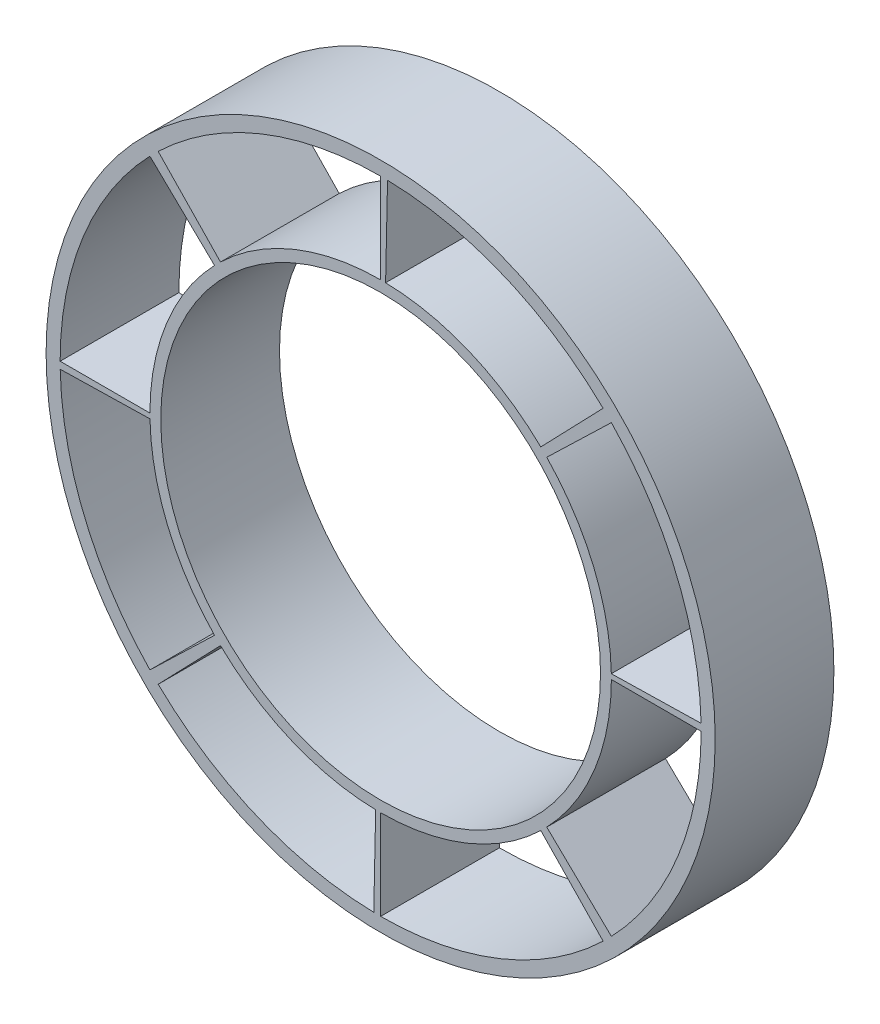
ISO-10303-21;
HEADER;
FILE_DESCRIPTION(('STEP AP214'),'2;1');
FILE_NAME('part.step','',(''),(''),'','','');
FILE_SCHEMA(('AUTOMOTIVE_DESIGN { 1 0 10303 214 1 1 1 1 }'));
ENDSEC;
DATA;
#1=APPLICATION_CONTEXT('core data for automotive mechanical design processes');
#2=APPLICATION_PROTOCOL_DEFINITION('international standard','automotive_design',2000,#1);
#3=PRODUCT_CONTEXT('',#1,'mechanical');
#4=PRODUCT('Part','Part','',(#3));
#5=PRODUCT_RELATED_PRODUCT_CATEGORY('part','',(#4));
#6=PRODUCT_DEFINITION_FORMATION('','',#4);
#7=PRODUCT_DEFINITION_CONTEXT('part definition',#1,'design');
#8=PRODUCT_DEFINITION('design','',#6,#7);
#9=PRODUCT_DEFINITION_SHAPE('','',#8);
#10=(LENGTH_UNIT() NAMED_UNIT(*) SI_UNIT(.MILLI.,.METRE.));
#11=(NAMED_UNIT(*) PLANE_ANGLE_UNIT() SI_UNIT($,.RADIAN.));
#12=(NAMED_UNIT(*) SI_UNIT($,.STERADIAN.) SOLID_ANGLE_UNIT());
#13=UNCERTAINTY_MEASURE_WITH_UNIT(LENGTH_MEASURE(1.E-05),#10,'distance_accuracy_value','');
#14=(GEOMETRIC_REPRESENTATION_CONTEXT(3) GLOBAL_UNCERTAINTY_ASSIGNED_CONTEXT((#13)) GLOBAL_UNIT_ASSIGNED_CONTEXT((#10,
#11,#12)) REPRESENTATION_CONTEXT('',''));
#15=CARTESIAN_POINT('',(0.,0.,0.));
#16=DIRECTION('',(0.,0.,1.));
#17=DIRECTION('',(1.,0.,0.));
#18=AXIS2_PLACEMENT_3D('',#15,#16,#17);
#19=CARTESIAN_POINT('',(0.,0.,10.));
#20=DIRECTION('',(0.,0.,-1.));
#21=DIRECTION('',(-1.,0.,0.));
#22=AXIS2_PLACEMENT_3D('',#19,#20,#21);
#23=CYLINDRICAL_SURFACE('',#22,26.9983120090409);
#24=CARTESIAN_POINT('',(0.,0.,0.));
#25=DIRECTION('',(0.,0.,1.));
#26=DIRECTION('',(1.,0.,0.));
#27=AXIS2_PLACEMENT_3D('',#24,#25,#26);
#28=CIRCLE('',#27,26.9983120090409);
#29=CARTESIAN_POINT('',(-26.9920373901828,-0.582038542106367,0.));
#30=VERTEX_POINT('',#29);
#31=CARTESIAN_POINT('',(-19.4359711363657,-18.7390468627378,0.));
#32=VERTEX_POINT('',#31);
#33=EDGE_CURVE('E430',#30,#32,#28,.T.);
#34=ORIENTED_EDGE('',*,*,#33,.F.);
#35=DIRECTION('',(0.,0.,-1.));
#36=VECTOR('',#35,1.);
#37=CARTESIAN_POINT('',(-26.9920373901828,-0.582038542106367,10.));
#38=LINE('',#37,#36);
#39=CARTESIAN_POINT('',(-26.9920373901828,-0.582038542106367,10.));
#40=VERTEX_POINT('',#39);
#41=EDGE_CURVE('E11',#40,#30,#38,.T.);
#42=ORIENTED_EDGE('',*,*,#41,.F.);
#43=CARTESIAN_POINT('',(0.,0.,10.));
#44=DIRECTION('',(0.,0.,1.));
#45=DIRECTION('',(1.,0.,0.));
#46=AXIS2_PLACEMENT_3D('',#43,#44,#45);
#47=CIRCLE('',#46,26.9983120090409);
#48=CARTESIAN_POINT('',(-19.4359711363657,-18.7390468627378,10.));
#49=VERTEX_POINT('',#48);
#50=EDGE_CURVE('E266',#40,#49,#47,.T.);
#51=ORIENTED_EDGE('',*,*,#50,.T.);
#52=DIRECTION('',(0.,0.,-1.));
#53=VECTOR('',#52,1.);
#54=CARTESIAN_POINT('',(-19.4359711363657,-18.7390468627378,10.));
#55=LINE('',#54,#53);
#56=EDGE_CURVE('E54',#49,#32,#55,.T.);
#57=ORIENTED_EDGE('',*,*,#56,.T.);
#58=EDGE_LOOP('',(#34,#42,#51,#57));
#59=FACE_BOUND('',#58,.T.);
#60=ADVANCED_FACE('F35',(#59),#23,.F.);
#61=CARTESIAN_POINT('',(0.,0.,10.));
#62=DIRECTION('',(-0.0215583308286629,0.999767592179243,0.));
#63=DIRECTION('',(-0.999767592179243,-0.0215583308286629,0.));
#64=AXIS2_PLACEMENT_3D('',#61,#62,#63);
#65=PLANE('',#64);
#66=DIRECTION('',(0.999767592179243,0.0215583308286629,0.));
#67=VECTOR('',#66,1.);
#68=CARTESIAN_POINT('',(0.,0.,0.));
#69=LINE('',#68,#67);
#70=CARTESIAN_POINT('',(-19.4314540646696,-0.419007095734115,0.));
#71=VERTEX_POINT('',#70);
#72=EDGE_CURVE('E271',#30,#71,#69,.T.);
#73=ORIENTED_EDGE('',*,*,#72,.T.);
#74=DIRECTION('',(0.,0.,-1.));
#75=VECTOR('',#74,1.);
#76=CARTESIAN_POINT('',(-19.4314540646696,-0.419007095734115,10.));
#77=LINE('',#76,#75);
#78=CARTESIAN_POINT('',(-19.4314540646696,-0.419007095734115,10.));
#79=VERTEX_POINT('',#78);
#80=EDGE_CURVE('E45',#79,#71,#77,.T.);
#81=ORIENTED_EDGE('',*,*,#80,.F.);
#82=DIRECTION('',(0.999767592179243,0.0215583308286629,0.));
#83=VECTOR('',#82,1.);
#84=CARTESIAN_POINT('',(0.,0.,10.));
#85=LINE('',#84,#83);
#86=EDGE_CURVE('E260',#40,#79,#85,.T.);
#87=ORIENTED_EDGE('',*,*,#86,.F.);
#88=ORIENTED_EDGE('',*,*,#41,.T.);
#89=EDGE_LOOP('',(#73,#81,#87,#88));
#90=FACE_BOUND('',#89,.T.);
#91=ADVANCED_FACE('F269',(#90),#65,.F.);
#92=CARTESIAN_POINT('',(0.,0.,10.));
#93=DIRECTION('',(0.,0.,-1.));
#94=DIRECTION('',(-1.,0.,0.));
#95=AXIS2_PLACEMENT_3D('',#92,#93,#94);
#96=CYLINDRICAL_SURFACE('',#95,19.4359711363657);
#97=CARTESIAN_POINT('',(0.,0.,0.));
#98=DIRECTION('',(0.,0.,1.));
#99=DIRECTION('',(1.,0.,0.));
#100=AXIS2_PLACEMENT_3D('',#97,#98,#99);
#101=CIRCLE('',#100,19.4359711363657);
#102=CARTESIAN_POINT('',(-13.9918737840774,-13.4901609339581,0.));
#103=VERTEX_POINT('',#102);
#104=EDGE_CURVE('E433',#71,#103,#101,.T.);
#105=ORIENTED_EDGE('',*,*,#104,.T.);
#106=DIRECTION('',(0.,0.,-1.));
#107=VECTOR('',#106,1.);
#108=CARTESIAN_POINT('',(-13.9918737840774,-13.4901609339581,10.));
#109=LINE('',#108,#107);
#110=CARTESIAN_POINT('',(-13.9918737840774,-13.4901609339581,10.));
#111=VERTEX_POINT('',#110);
#112=EDGE_CURVE('E152',#111,#103,#109,.T.);
#113=ORIENTED_EDGE('',*,*,#112,.F.);
#114=CARTESIAN_POINT('',(0.,0.,10.));
#115=DIRECTION('',(0.,0.,1.));
#116=DIRECTION('',(1.,0.,0.));
#117=AXIS2_PLACEMENT_3D('',#114,#115,#116);
#118=CIRCLE('',#117,19.4359711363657);
#119=EDGE_CURVE('E252',#79,#111,#118,.T.);
#120=ORIENTED_EDGE('',*,*,#119,.F.);
#121=ORIENTED_EDGE('',*,*,#80,.T.);
#122=EDGE_LOOP('',(#105,#113,#120,#121));
#123=FACE_BOUND('',#122,.T.);
#124=ADVANCED_FACE('F254',(#123),#96,.T.);
#125=CARTESIAN_POINT('',(0.,0.,10.));
#126=DIRECTION('',(0.,0.,-1.));
#127=DIRECTION('',(-1.,0.,0.));
#128=AXIS2_PLACEMENT_3D('',#125,#126,#127);
#129=CYLINDRICAL_SURFACE('',#128,26.9983120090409);
#130=CARTESIAN_POINT('',(0.,0.,0.));
#131=DIRECTION('',(0.,0.,1.));
#132=DIRECTION('',(1.,0.,0.));
#133=AXIS2_PLACEMENT_3D('',#130,#131,#132);
#134=CIRCLE('',#133,26.9983120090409);
#135=CARTESIAN_POINT('',(-18.7390468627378,-19.4359711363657,0.));
#136=VERTEX_POINT('',#135);
#137=CARTESIAN_POINT('',(-0.580474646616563,-26.9920710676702,0.));
#138=VERTEX_POINT('',#137);
#139=EDGE_CURVE('E418',#136,#138,#134,.T.);
#140=ORIENTED_EDGE('',*,*,#139,.F.);
#141=DIRECTION('',(0.,0.,-1.));
#142=VECTOR('',#141,1.);
#143=CARTESIAN_POINT('',(-18.7390468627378,-19.4359711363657,10.));
#144=LINE('',#143,#142);
#145=CARTESIAN_POINT('',(-18.7390468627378,-19.4359711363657,10.));
#146=VERTEX_POINT('',#145);
#147=EDGE_CURVE('E284',#146,#136,#144,.T.);
#148=ORIENTED_EDGE('',*,*,#147,.F.);
#149=CARTESIAN_POINT('',(0.,0.,10.));
#150=DIRECTION('',(0.,0.,1.));
#151=DIRECTION('',(1.,0.,0.));
#152=AXIS2_PLACEMENT_3D('',#149,#150,#151);
#153=CIRCLE('',#152,26.9983120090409);
#154=CARTESIAN_POINT('',(-0.580474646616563,-26.9920710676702,10.));
#155=VERTEX_POINT('',#154);
#156=EDGE_CURVE('E510',#146,#155,#153,.T.);
#157=ORIENTED_EDGE('',*,*,#156,.T.);
#158=DIRECTION('',(0.,0.,-1.));
#159=VECTOR('',#158,1.);
#160=CARTESIAN_POINT('',(-0.580474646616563,-26.9920710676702,10.));
#161=LINE('',#160,#159);
#162=EDGE_CURVE('E276',#155,#138,#161,.T.);
#163=ORIENTED_EDGE('',*,*,#162,.T.);
#164=EDGE_LOOP('',(#140,#148,#157,#163));
#165=FACE_BOUND('',#164,.T.);
#166=ADVANCED_FACE('F567',(#165),#129,.F.);
#167=CARTESIAN_POINT('',(0.,0.,10.));
#168=DIRECTION('',(0.719895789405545,-0.694082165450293,0.));
#169=DIRECTION('',(0.694082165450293,0.719895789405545,0.));
#170=AXIS2_PLACEMENT_3D('',#167,#168,#169);
#171=PLANE('',#170);
#172=DIRECTION('',(-0.694082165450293,-0.719895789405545,0.));
#173=VECTOR('',#172,1.);
#174=CARTESIAN_POINT('',(0.,0.,0.));
#175=LINE('',#174,#173);
#176=CARTESIAN_POINT('',(-13.4901609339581,-13.9918737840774,0.));
#177=VERTEX_POINT('',#176);
#178=EDGE_CURVE('E421',#177,#136,#175,.T.);
#179=ORIENTED_EDGE('',*,*,#178,.F.);
#180=DIRECTION('',(0.,0.,-1.));
#181=VECTOR('',#180,1.);
#182=CARTESIAN_POINT('',(-13.4901609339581,-13.9918737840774,10.));
#183=LINE('',#182,#181);
#184=CARTESIAN_POINT('',(-13.4901609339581,-13.9918737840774,10.));
#185=VERTEX_POINT('',#184);
#186=EDGE_CURVE('E282',#185,#177,#183,.T.);
#187=ORIENTED_EDGE('',*,*,#186,.F.);
#188=DIRECTION('',(-0.694082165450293,-0.719895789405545,0.));
#189=VECTOR('',#188,1.);
#190=CARTESIAN_POINT('',(0.,0.,10.));
#191=LINE('',#190,#189);
#192=EDGE_CURVE('E513',#185,#146,#191,.T.);
#193=ORIENTED_EDGE('',*,*,#192,.T.);
#194=ORIENTED_EDGE('',*,*,#147,.T.);
#195=EDGE_LOOP('',(#179,#187,#193,#194));
#196=FACE_BOUND('',#195,.T.);
#197=ADVANCED_FACE('F563',(#196),#171,.T.);
#198=CARTESIAN_POINT('',(0.,0.,10.));
#199=DIRECTION('',(0.,0.,-1.));
#200=DIRECTION('',(-1.,0.,0.));
#201=AXIS2_PLACEMENT_3D('',#198,#199,#200);
#202=CYLINDRICAL_SURFACE('',#201,19.4359711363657);
#203=CARTESIAN_POINT('',(0.,0.,0.));
#204=DIRECTION('',(0.,0.,1.));
#205=DIRECTION('',(1.,0.,0.));
#206=AXIS2_PLACEMENT_3D('',#203,#204,#205);
#207=CIRCLE('',#206,19.4359711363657);
#208=CARTESIAN_POINT('',(-0.417881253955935,-19.431478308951,0.));
#209=VERTEX_POINT('',#208);
#210=EDGE_CURVE('E424',#177,#209,#207,.T.);
#211=ORIENTED_EDGE('',*,*,#210,.T.);
#212=DIRECTION('',(0.,0.,-1.));
#213=VECTOR('',#212,1.);
#214=CARTESIAN_POINT('',(-0.417881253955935,-19.431478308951,10.));
#215=LINE('',#214,#213);
#216=CARTESIAN_POINT('',(-0.417881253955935,-19.431478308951,10.));
#217=VERTEX_POINT('',#216);
#218=EDGE_CURVE('E278',#217,#209,#215,.T.);
#219=ORIENTED_EDGE('',*,*,#218,.F.);
#220=CARTESIAN_POINT('',(0.,0.,10.));
#221=DIRECTION('',(0.,0.,1.));
#222=DIRECTION('',(1.,0.,0.));
#223=AXIS2_PLACEMENT_3D('',#220,#221,#222);
#224=CIRCLE('',#223,19.4359711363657);
#225=EDGE_CURVE('E516',#185,#217,#224,.T.);
#226=ORIENTED_EDGE('',*,*,#225,.F.);
#227=ORIENTED_EDGE('',*,*,#186,.T.);
#228=EDGE_LOOP('',(#211,#219,#226,#227));
#229=FACE_BOUND('',#228,.T.);
#230=ADVANCED_FACE('F559',(#229),#202,.T.);
#231=CARTESIAN_POINT('',(0.,0.,10.));
#232=DIRECTION('',(0.,0.,-1.));
#233=DIRECTION('',(-1.,0.,0.));
#234=AXIS2_PLACEMENT_3D('',#231,#232,#233);
#235=CYLINDRICAL_SURFACE('',#234,26.9983120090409);
#236=CARTESIAN_POINT('',(0.,0.,0.));
#237=DIRECTION('',(0.,0.,1.));
#238=DIRECTION('',(1.,0.,0.));
#239=AXIS2_PLACEMENT_3D('',#236,#237,#238);
#240=CIRCLE('',#239,26.9983120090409);
#241=CARTESIAN_POINT('',(0.,-26.9983120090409,0.));
#242=VERTEX_POINT('',#241);
#243=CARTESIAN_POINT('',(18.7390468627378,-19.4359711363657,0.));
#244=VERTEX_POINT('',#243);
#245=EDGE_CURVE('E406',#242,#244,#240,.T.);
#246=ORIENTED_EDGE('',*,*,#245,.F.);
#247=DIRECTION('',(0.,0.,-1.));
#248=VECTOR('',#247,1.);
#249=CARTESIAN_POINT('',(0.,-26.9983120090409,10.));
#250=LINE('',#249,#248);
#251=CARTESIAN_POINT('',(0.,-26.9983120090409,10.));
#252=VERTEX_POINT('',#251);
#253=EDGE_CURVE('E279',#252,#242,#250,.T.);
#254=ORIENTED_EDGE('',*,*,#253,.F.);
#255=CARTESIAN_POINT('',(0.,0.,10.));
#256=DIRECTION('',(0.,0.,1.));
#257=DIRECTION('',(1.,0.,0.));
#258=AXIS2_PLACEMENT_3D('',#255,#256,#257);
#259=CIRCLE('',#258,26.9983120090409);
#260=CARTESIAN_POINT('',(18.7390468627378,-19.4359711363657,10.));
#261=VERTEX_POINT('',#260);
#262=EDGE_CURVE('E499',#252,#261,#259,.T.);
#263=ORIENTED_EDGE('',*,*,#262,.T.);
#264=DIRECTION('',(0.,0.,-1.));
#265=VECTOR('',#264,1.);
#266=CARTESIAN_POINT('',(18.7390468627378,-19.4359711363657,10.));
#267=LINE('',#266,#265);
#268=EDGE_CURVE('E286',#261,#244,#267,.T.);
#269=ORIENTED_EDGE('',*,*,#268,.T.);
#270=EDGE_LOOP('',(#246,#254,#263,#269));
#271=FACE_BOUND('',#270,.T.);
#272=ADVANCED_FACE('F562',(#271),#235,.F.);
#273=CARTESIAN_POINT('',(0.,0.,10.));
#274=DIRECTION('',(1.,0.,0.));
#275=DIRECTION('',(0.,0.,-1.));
#276=AXIS2_PLACEMENT_3D('',#273,#274,#275);
#277=PLANE('',#276);
#278=DIRECTION('',(0.,-1.,0.));
#279=VECTOR('',#278,1.);
#280=CARTESIAN_POINT('',(0.,0.,0.));
#281=LINE('',#280,#279);
#282=CARTESIAN_POINT('',(0.,-19.4359711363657,0.));
#283=VERTEX_POINT('',#282);
#284=EDGE_CURVE('E409',#283,#242,#281,.T.);
#285=ORIENTED_EDGE('',*,*,#284,.F.);
#286=DIRECTION('',(0.,0.,-1.));
#287=VECTOR('',#286,1.);
#288=CARTESIAN_POINT('',(0.,-19.4359711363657,10.));
#289=LINE('',#288,#287);
#290=CARTESIAN_POINT('',(0.,-19.4359711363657,10.));
#291=VERTEX_POINT('',#290);
#292=EDGE_CURVE('E292',#291,#283,#289,.T.);
#293=ORIENTED_EDGE('',*,*,#292,.F.);
#294=DIRECTION('',(0.,-1.,0.));
#295=VECTOR('',#294,1.);
#296=CARTESIAN_POINT('',(0.,0.,10.));
#297=LINE('',#296,#295);
#298=EDGE_CURVE('E502',#291,#252,#297,.T.);
#299=ORIENTED_EDGE('',*,*,#298,.T.);
#300=ORIENTED_EDGE('',*,*,#253,.T.);
#301=EDGE_LOOP('',(#285,#293,#299,#300));
#302=FACE_BOUND('',#301,.T.);
#303=ADVANCED_FACE('F580',(#302),#277,.T.);
#304=CARTESIAN_POINT('',(0.,0.,10.));
#305=DIRECTION('',(0.,0.,-1.));
#306=DIRECTION('',(-1.,0.,0.));
#307=AXIS2_PLACEMENT_3D('',#304,#305,#306);
#308=CYLINDRICAL_SURFACE('',#307,19.4359711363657);
#309=CARTESIAN_POINT('',(0.,0.,0.));
#310=DIRECTION('',(0.,0.,1.));
#311=DIRECTION('',(1.,0.,0.));
#312=AXIS2_PLACEMENT_3D('',#309,#310,#311);
#313=CIRCLE('',#312,19.4359711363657);
#314=CARTESIAN_POINT('',(13.4901609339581,-13.9918737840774,0.));
#315=VERTEX_POINT('',#314);
#316=EDGE_CURVE('E412',#283,#315,#313,.T.);
#317=ORIENTED_EDGE('',*,*,#316,.T.);
#318=DIRECTION('',(0.,0.,-1.));
#319=VECTOR('',#318,1.);
#320=CARTESIAN_POINT('',(13.4901609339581,-13.9918737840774,10.));
#321=LINE('',#320,#319);
#322=CARTESIAN_POINT('',(13.4901609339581,-13.9918737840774,10.));
#323=VERTEX_POINT('',#322);
#324=EDGE_CURVE('E288',#323,#315,#321,.T.);
#325=ORIENTED_EDGE('',*,*,#324,.F.);
#326=CARTESIAN_POINT('',(0.,0.,10.));
#327=DIRECTION('',(0.,0.,1.));
#328=DIRECTION('',(1.,0.,0.));
#329=AXIS2_PLACEMENT_3D('',#326,#327,#328);
#330=CIRCLE('',#329,19.4359711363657);
#331=EDGE_CURVE('E505',#291,#323,#330,.T.);
#332=ORIENTED_EDGE('',*,*,#331,.F.);
#333=ORIENTED_EDGE('',*,*,#292,.T.);
#334=EDGE_LOOP('',(#317,#325,#332,#333));
#335=FACE_BOUND('',#334,.T.);
#336=ADVANCED_FACE('F576',(#335),#308,.T.);
#337=CARTESIAN_POINT('',(0.,0.,10.));
#338=DIRECTION('',(0.,0.,-1.));
#339=DIRECTION('',(-1.,0.,0.));
#340=AXIS2_PLACEMENT_3D('',#337,#338,#339);
#341=CYLINDRICAL_SURFACE('',#340,26.9983120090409);
#342=CARTESIAN_POINT('',(0.,0.,0.));
#343=DIRECTION('',(0.,0.,1.));
#344=DIRECTION('',(1.,0.,0.));
#345=AXIS2_PLACEMENT_3D('',#342,#343,#344);
#346=CIRCLE('',#345,26.9983120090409);
#347=CARTESIAN_POINT('',(19.4359711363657,-18.7390468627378,0.));
#348=VERTEX_POINT('',#347);
#349=CARTESIAN_POINT('',(26.9983120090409,0.,0.));
#350=VERTEX_POINT('',#349);
#351=EDGE_CURVE('E394',#348,#350,#346,.T.);
#352=ORIENTED_EDGE('',*,*,#351,.F.);
#353=DIRECTION('',(0.,0.,-1.));
#354=VECTOR('',#353,1.);
#355=CARTESIAN_POINT('',(19.4359711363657,-18.7390468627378,10.));
#356=LINE('',#355,#354);
#357=CARTESIAN_POINT('',(19.4359711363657,-18.7390468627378,10.));
#358=VERTEX_POINT('',#357);
#359=EDGE_CURVE('E289',#358,#348,#356,.T.);
#360=ORIENTED_EDGE('',*,*,#359,.F.);
#361=CARTESIAN_POINT('',(0.,0.,10.));
#362=DIRECTION('',(0.,0.,1.));
#363=DIRECTION('',(1.,0.,0.));
#364=AXIS2_PLACEMENT_3D('',#361,#362,#363);
#365=CIRCLE('',#364,26.9983120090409);
#366=CARTESIAN_POINT('',(26.9983120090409,0.,10.));
#367=VERTEX_POINT('',#366);
#368=EDGE_CURVE('E488',#358,#367,#365,.T.);
#369=ORIENTED_EDGE('',*,*,#368,.T.);
#370=DIRECTION('',(0.,0.,-1.));
#371=VECTOR('',#370,1.);
#372=CARTESIAN_POINT('',(26.9983120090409,0.,10.));
#373=LINE('',#372,#371);
#374=EDGE_CURVE('E295',#367,#350,#373,.T.);
#375=ORIENTED_EDGE('',*,*,#374,.T.);
#376=EDGE_LOOP('',(#352,#360,#369,#375));
#377=FACE_BOUND('',#376,.T.);
#378=ADVANCED_FACE('F579',(#377),#341,.F.);
#379=CARTESIAN_POINT('',(0.,0.,10.));
#380=DIRECTION('',(0.694082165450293,0.719895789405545,0.));
#381=DIRECTION('',(-0.719895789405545,0.694082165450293,0.));
#382=AXIS2_PLACEMENT_3D('',#379,#380,#381);
#383=PLANE('',#382);
#384=DIRECTION('',(0.719895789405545,-0.694082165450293,0.));
#385=VECTOR('',#384,1.);
#386=CARTESIAN_POINT('',(0.,0.,0.));
#387=LINE('',#386,#385);
#388=CARTESIAN_POINT('',(13.9918737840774,-13.4901609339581,0.));
#389=VERTEX_POINT('',#388);
#390=EDGE_CURVE('E397',#389,#348,#387,.T.);
#391=ORIENTED_EDGE('',*,*,#390,.F.);
#392=DIRECTION('',(0.,0.,-1.));
#393=VECTOR('',#392,1.);
#394=CARTESIAN_POINT('',(13.9918737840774,-13.4901609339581,10.));
#395=LINE('',#394,#393);
#396=CARTESIAN_POINT('',(13.9918737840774,-13.4901609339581,10.));
#397=VERTEX_POINT('',#396);
#398=EDGE_CURVE('E301',#397,#389,#395,.T.);
#399=ORIENTED_EDGE('',*,*,#398,.F.);
#400=DIRECTION('',(0.719895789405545,-0.694082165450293,0.));
#401=VECTOR('',#400,1.);
#402=CARTESIAN_POINT('',(0.,0.,10.));
#403=LINE('',#402,#401);
#404=EDGE_CURVE('E491',#397,#358,#403,.T.);
#405=ORIENTED_EDGE('',*,*,#404,.T.);
#406=ORIENTED_EDGE('',*,*,#359,.T.);
#407=EDGE_LOOP('',(#391,#399,#405,#406));
#408=FACE_BOUND('',#407,.T.);
#409=ADVANCED_FACE('F596',(#408),#383,.T.);
#410=CARTESIAN_POINT('',(0.,0.,10.));
#411=DIRECTION('',(0.,0.,-1.));
#412=DIRECTION('',(-1.,0.,0.));
#413=AXIS2_PLACEMENT_3D('',#410,#411,#412);
#414=CYLINDRICAL_SURFACE('',#413,19.4359711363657);
#415=CARTESIAN_POINT('',(0.,0.,0.));
#416=DIRECTION('',(0.,0.,1.));
#417=DIRECTION('',(1.,0.,0.));
#418=AXIS2_PLACEMENT_3D('',#415,#416,#417);
#419=CIRCLE('',#418,19.4359711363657);
#420=CARTESIAN_POINT('',(19.4359711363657,0.,0.));
#421=VERTEX_POINT('',#420);
#422=EDGE_CURVE('E400',#389,#421,#419,.T.);
#423=ORIENTED_EDGE('',*,*,#422,.T.);
#424=DIRECTION('',(0.,0.,-1.));
#425=VECTOR('',#424,1.);
#426=CARTESIAN_POINT('',(19.4359711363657,0.,10.));
#427=LINE('',#426,#425);
#428=CARTESIAN_POINT('',(19.4359711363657,0.,10.));
#429=VERTEX_POINT('',#428);
#430=EDGE_CURVE('E297',#429,#421,#427,.T.);
#431=ORIENTED_EDGE('',*,*,#430,.F.);
#432=CARTESIAN_POINT('',(0.,0.,10.));
#433=DIRECTION('',(0.,0.,1.));
#434=DIRECTION('',(1.,0.,0.));
#435=AXIS2_PLACEMENT_3D('',#432,#433,#434);
#436=CIRCLE('',#435,19.4359711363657);
#437=EDGE_CURVE('E494',#397,#429,#436,.T.);
#438=ORIENTED_EDGE('',*,*,#437,.F.);
#439=ORIENTED_EDGE('',*,*,#398,.T.);
#440=EDGE_LOOP('',(#423,#431,#438,#439));
#441=FACE_BOUND('',#440,.T.);
#442=ADVANCED_FACE('F592',(#441),#414,.T.);
#443=CARTESIAN_POINT('',(0.,0.,10.));
#444=DIRECTION('',(0.,0.,-1.));
#445=DIRECTION('',(-1.,0.,0.));
#446=AXIS2_PLACEMENT_3D('',#443,#444,#445);
#447=CYLINDRICAL_SURFACE('',#446,26.9983120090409);
#448=CARTESIAN_POINT('',(0.,0.,0.));
#449=DIRECTION('',(0.,0.,1.));
#450=DIRECTION('',(1.,0.,0.));
#451=AXIS2_PLACEMENT_3D('',#448,#449,#450);
#452=CIRCLE('',#451,26.9983120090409);
#453=CARTESIAN_POINT('',(26.9920373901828,0.582038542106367,0.));
#454=VERTEX_POINT('',#453);
#455=CARTESIAN_POINT('',(19.4359711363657,18.7390468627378,0.));
#456=VERTEX_POINT('',#455);
#457=EDGE_CURVE('E382',#454,#456,#452,.T.);
#458=ORIENTED_EDGE('',*,*,#457,.F.);
#459=DIRECTION('',(0.,0.,-1.));
#460=VECTOR('',#459,1.);
#461=CARTESIAN_POINT('',(26.9920373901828,0.582038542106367,10.));
#462=LINE('',#461,#460);
#463=CARTESIAN_POINT('',(26.9920373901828,0.582038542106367,10.));
#464=VERTEX_POINT('',#463);
#465=EDGE_CURVE('E298',#464,#454,#462,.T.);
#466=ORIENTED_EDGE('',*,*,#465,.F.);
#467=CARTESIAN_POINT('',(0.,0.,10.));
#468=DIRECTION('',(0.,0.,1.));
#469=DIRECTION('',(1.,0.,0.));
#470=AXIS2_PLACEMENT_3D('',#467,#468,#469);
#471=CIRCLE('',#470,26.9983120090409);
#472=CARTESIAN_POINT('',(19.4359711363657,18.7390468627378,10.));
#473=VERTEX_POINT('',#472);
#474=EDGE_CURVE('E477',#464,#473,#471,.T.);
#475=ORIENTED_EDGE('',*,*,#474,.T.);
#476=DIRECTION('',(0.,0.,-1.));
#477=VECTOR('',#476,1.);
#478=CARTESIAN_POINT('',(19.4359711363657,18.7390468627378,10.));
#479=LINE('',#478,#477);
#480=EDGE_CURVE('E304',#473,#456,#479,.T.);
#481=ORIENTED_EDGE('',*,*,#480,.T.);
#482=EDGE_LOOP('',(#458,#466,#475,#481));
#483=FACE_BOUND('',#482,.T.);
#484=ADVANCED_FACE('F595',(#483),#447,.F.);
#485=CARTESIAN_POINT('',(0.,0.,10.));
#486=DIRECTION('',(-0.0215583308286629,0.999767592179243,0.));
#487=DIRECTION('',(-0.999767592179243,-0.0215583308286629,0.));
#488=AXIS2_PLACEMENT_3D('',#485,#486,#487);
#489=PLANE('',#488);
#490=DIRECTION('',(0.999767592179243,0.0215583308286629,0.));
#491=VECTOR('',#490,1.);
#492=CARTESIAN_POINT('',(0.,0.,0.));
#493=LINE('',#492,#491);
#494=CARTESIAN_POINT('',(19.4314540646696,0.419007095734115,0.));
#495=VERTEX_POINT('',#494);
#496=EDGE_CURVE('E385',#495,#454,#493,.T.);
#497=ORIENTED_EDGE('',*,*,#496,.F.);
#498=DIRECTION('',(0.,0.,-1.));
#499=VECTOR('',#498,1.);
#500=CARTESIAN_POINT('',(19.4314540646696,0.419007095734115,10.));
#501=LINE('',#500,#499);
#502=CARTESIAN_POINT('',(19.4314540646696,0.419007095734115,10.));
#503=VERTEX_POINT('',#502);
#504=EDGE_CURVE('E310',#503,#495,#501,.T.);
#505=ORIENTED_EDGE('',*,*,#504,.F.);
#506=DIRECTION('',(0.999767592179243,0.0215583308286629,0.));
#507=VECTOR('',#506,1.);
#508=CARTESIAN_POINT('',(0.,0.,10.));
#509=LINE('',#508,#507);
#510=EDGE_CURVE('E480',#503,#464,#509,.T.);
#511=ORIENTED_EDGE('',*,*,#510,.T.);
#512=ORIENTED_EDGE('',*,*,#465,.T.);
#513=EDGE_LOOP('',(#497,#505,#511,#512));
#514=FACE_BOUND('',#513,.T.);
#515=ADVANCED_FACE('F612',(#514),#489,.T.);
#516=CARTESIAN_POINT('',(0.,0.,10.));
#517=DIRECTION('',(0.,0.,-1.));
#518=DIRECTION('',(-1.,0.,0.));
#519=AXIS2_PLACEMENT_3D('',#516,#517,#518);
#520=CYLINDRICAL_SURFACE('',#519,19.4359711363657);
#521=CARTESIAN_POINT('',(0.,0.,0.));
#522=DIRECTION('',(0.,0.,1.));
#523=DIRECTION('',(1.,0.,0.));
#524=AXIS2_PLACEMENT_3D('',#521,#522,#523);
#525=CIRCLE('',#524,19.4359711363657);
#526=CARTESIAN_POINT('',(13.9918737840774,13.4901609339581,0.));
#527=VERTEX_POINT('',#526);
#528=EDGE_CURVE('E388',#495,#527,#525,.T.);
#529=ORIENTED_EDGE('',*,*,#528,.T.);
#530=DIRECTION('',(0.,0.,-1.));
#531=VECTOR('',#530,1.);
#532=CARTESIAN_POINT('',(13.9918737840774,13.4901609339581,10.));
#533=LINE('',#532,#531);
#534=CARTESIAN_POINT('',(13.9918737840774,13.4901609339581,10.));
#535=VERTEX_POINT('',#534);
#536=EDGE_CURVE('E306',#535,#527,#533,.T.);
#537=ORIENTED_EDGE('',*,*,#536,.F.);
#538=CARTESIAN_POINT('',(0.,0.,10.));
#539=DIRECTION('',(0.,0.,1.));
#540=DIRECTION('',(1.,0.,0.));
#541=AXIS2_PLACEMENT_3D('',#538,#539,#540);
#542=CIRCLE('',#541,19.4359711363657);
#543=EDGE_CURVE('E483',#503,#535,#542,.T.);
#544=ORIENTED_EDGE('',*,*,#543,.F.);
#545=ORIENTED_EDGE('',*,*,#504,.T.);
#546=EDGE_LOOP('',(#529,#537,#544,#545));
#547=FACE_BOUND('',#546,.T.);
#548=ADVANCED_FACE('F608',(#547),#520,.T.);
#549=CARTESIAN_POINT('',(0.,0.,10.));
#550=DIRECTION('',(0.,0.,-1.));
#551=DIRECTION('',(-1.,0.,0.));
#552=AXIS2_PLACEMENT_3D('',#549,#550,#551);
#553=CYLINDRICAL_SURFACE('',#552,26.9983120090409);
#554=CARTESIAN_POINT('',(0.,0.,0.));
#555=DIRECTION('',(0.,0.,1.));
#556=DIRECTION('',(1.,0.,0.));
#557=AXIS2_PLACEMENT_3D('',#554,#555,#556);
#558=CIRCLE('',#557,26.9983120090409);
#559=CARTESIAN_POINT('',(18.7390468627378,19.4359711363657,0.));
#560=VERTEX_POINT('',#559);
#561=CARTESIAN_POINT('',(0.580474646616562,26.9920710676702,0.));
#562=VERTEX_POINT('',#561);
#563=EDGE_CURVE('E370',#560,#562,#558,.T.);
#564=ORIENTED_EDGE('',*,*,#563,.F.);
#565=DIRECTION('',(0.,0.,-1.));
#566=VECTOR('',#565,1.);
#567=CARTESIAN_POINT('',(18.7390468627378,19.4359711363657,10.));
#568=LINE('',#567,#566);
#569=CARTESIAN_POINT('',(18.7390468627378,19.4359711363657,10.));
#570=VERTEX_POINT('',#569);
#571=EDGE_CURVE('E307',#570,#560,#568,.T.);
#572=ORIENTED_EDGE('',*,*,#571,.F.);
#573=CARTESIAN_POINT('',(0.,0.,10.));
#574=DIRECTION('',(0.,0.,1.));
#575=DIRECTION('',(1.,0.,0.));
#576=AXIS2_PLACEMENT_3D('',#573,#574,#575);
#577=CIRCLE('',#576,26.9983120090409);
#578=CARTESIAN_POINT('',(0.580474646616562,26.9920710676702,10.));
#579=VERTEX_POINT('',#578);
#580=EDGE_CURVE('E466',#570,#579,#577,.T.);
#581=ORIENTED_EDGE('',*,*,#580,.T.);
#582=DIRECTION('',(0.,0.,-1.));
#583=VECTOR('',#582,1.);
#584=CARTESIAN_POINT('',(0.580474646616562,26.9920710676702,10.));
#585=LINE('',#584,#583);
#586=EDGE_CURVE('E313',#579,#562,#585,.T.);
#587=ORIENTED_EDGE('',*,*,#586,.T.);
#588=EDGE_LOOP('',(#564,#572,#581,#587));
#589=FACE_BOUND('',#588,.T.);
#590=ADVANCED_FACE('F611',(#589),#553,.F.);
#591=CARTESIAN_POINT('',(0.,0.,10.));
#592=DIRECTION('',(0.719895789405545,-0.694082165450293,0.));
#593=DIRECTION('',(0.694082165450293,0.719895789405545,0.));
#594=AXIS2_PLACEMENT_3D('',#591,#592,#593);
#595=PLANE('',#594);
#596=DIRECTION('',(-0.694082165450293,-0.719895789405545,0.));
#597=VECTOR('',#596,1.);
#598=CARTESIAN_POINT('',(0.,0.,0.));
#599=LINE('',#598,#597);
#600=CARTESIAN_POINT('',(13.4901609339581,13.9918737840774,0.));
#601=VERTEX_POINT('',#600);
#602=EDGE_CURVE('E373',#560,#601,#599,.T.);
#603=ORIENTED_EDGE('',*,*,#602,.T.);
#604=DIRECTION('',(0.,0.,-1.));
#605=VECTOR('',#604,1.);
#606=CARTESIAN_POINT('',(13.4901609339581,13.9918737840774,10.));
#607=LINE('',#606,#605);
#608=CARTESIAN_POINT('',(13.4901609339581,13.9918737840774,10.));
#609=VERTEX_POINT('',#608);
#610=EDGE_CURVE('E318',#609,#601,#607,.T.);
#611=ORIENTED_EDGE('',*,*,#610,.F.);
#612=DIRECTION('',(-0.694082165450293,-0.719895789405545,0.));
#613=VECTOR('',#612,1.);
#614=CARTESIAN_POINT('',(0.,0.,10.));
#615=LINE('',#614,#613);
#616=EDGE_CURVE('E469',#570,#609,#615,.T.);
#617=ORIENTED_EDGE('',*,*,#616,.F.);
#618=ORIENTED_EDGE('',*,*,#571,.T.);
#619=EDGE_LOOP('',(#603,#611,#617,#618));
#620=FACE_BOUND('',#619,.T.);
#621=ADVANCED_FACE('F627',(#620),#595,.F.);
#622=CARTESIAN_POINT('',(0.,0.,10.));
#623=DIRECTION('',(0.,0.,-1.));
#624=DIRECTION('',(-1.,0.,0.));
#625=AXIS2_PLACEMENT_3D('',#622,#623,#624);
#626=CYLINDRICAL_SURFACE('',#625,19.4359711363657);
#627=CARTESIAN_POINT('',(0.,0.,0.));
#628=DIRECTION('',(0.,0.,1.));
#629=DIRECTION('',(1.,0.,0.));
#630=AXIS2_PLACEMENT_3D('',#627,#628,#629);
#631=CIRCLE('',#630,19.4359711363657);
#632=CARTESIAN_POINT('',(0.417881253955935,19.431478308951,0.));
#633=VERTEX_POINT('',#632);
#634=EDGE_CURVE('E376',#601,#633,#631,.T.);
#635=ORIENTED_EDGE('',*,*,#634,.T.);
#636=DIRECTION('',(0.,0.,-1.));
#637=VECTOR('',#636,1.);
#638=CARTESIAN_POINT('',(0.417881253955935,19.431478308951,10.));
#639=LINE('',#638,#637);
#640=CARTESIAN_POINT('',(0.417881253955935,19.431478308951,10.));
#641=VERTEX_POINT('',#640);
#642=EDGE_CURVE('E315',#641,#633,#639,.T.);
#643=ORIENTED_EDGE('',*,*,#642,.F.);
#644=CARTESIAN_POINT('',(0.,0.,10.));
#645=DIRECTION('',(0.,0.,1.));
#646=DIRECTION('',(1.,0.,0.));
#647=AXIS2_PLACEMENT_3D('',#644,#645,#646);
#648=CIRCLE('',#647,19.4359711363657);
#649=EDGE_CURVE('E472',#609,#641,#648,.T.);
#650=ORIENTED_EDGE('',*,*,#649,.F.);
#651=ORIENTED_EDGE('',*,*,#610,.T.);
#652=EDGE_LOOP('',(#635,#643,#650,#651));
#653=FACE_BOUND('',#652,.T.);
#654=ADVANCED_FACE('F623',(#653),#626,.T.);
#655=CARTESIAN_POINT('',(0.,0.,10.));
#656=DIRECTION('',(0.,0.,-1.));
#657=DIRECTION('',(-1.,0.,0.));
#658=AXIS2_PLACEMENT_3D('',#655,#656,#657);
#659=CYLINDRICAL_SURFACE('',#658,26.9983120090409);
#660=CARTESIAN_POINT('',(0.,0.,0.));
#661=DIRECTION('',(0.,0.,1.));
#662=DIRECTION('',(1.,0.,0.));
#663=AXIS2_PLACEMENT_3D('',#660,#661,#662);
#664=CIRCLE('',#663,26.9983120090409);
#665=CARTESIAN_POINT('',(0.,26.9983120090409,0.));
#666=VERTEX_POINT('',#665);
#667=CARTESIAN_POINT('',(-18.7390468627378,19.4359711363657,0.));
#668=VERTEX_POINT('',#667);
#669=EDGE_CURVE('E361',#666,#668,#664,.T.);
#670=ORIENTED_EDGE('',*,*,#669,.F.);
#671=DIRECTION('',(0.,0.,-1.));
#672=VECTOR('',#671,1.);
#673=CARTESIAN_POINT('',(0.,26.9983120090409,10.));
#674=LINE('',#673,#672);
#675=CARTESIAN_POINT('',(0.,26.9983120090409,10.));
#676=VERTEX_POINT('',#675);
#677=EDGE_CURVE('E316',#676,#666,#674,.T.);
#678=ORIENTED_EDGE('',*,*,#677,.F.);
#679=CARTESIAN_POINT('',(0.,0.,10.));
#680=DIRECTION('',(0.,0.,1.));
#681=DIRECTION('',(1.,0.,0.));
#682=AXIS2_PLACEMENT_3D('',#679,#680,#681);
#683=CIRCLE('',#682,26.9983120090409);
#684=CARTESIAN_POINT('',(-18.7390468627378,19.4359711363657,10.));
#685=VERTEX_POINT('',#684);
#686=EDGE_CURVE('E457',#676,#685,#683,.T.);
#687=ORIENTED_EDGE('',*,*,#686,.T.);
#688=DIRECTION('',(0.,0.,-1.));
#689=VECTOR('',#688,1.);
#690=CARTESIAN_POINT('',(-18.7390468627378,19.4359711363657,10.));
#691=LINE('',#690,#689);
#692=EDGE_CURVE('E322',#685,#668,#691,.T.);
#693=ORIENTED_EDGE('',*,*,#692,.T.);
#694=EDGE_LOOP('',(#670,#678,#687,#693));
#695=FACE_BOUND('',#694,.T.);
#696=ADVANCED_FACE('F626',(#695),#659,.F.);
#697=CARTESIAN_POINT('',(0.,0.,10.));
#698=DIRECTION('',(1.,0.,0.));
#699=DIRECTION('',(0.,0.,-1.));
#700=AXIS2_PLACEMENT_3D('',#697,#698,#699);
#701=PLANE('',#700);
#702=DIRECTION('',(0.,-1.,0.));
#703=VECTOR('',#702,1.);
#704=CARTESIAN_POINT('',(0.,0.,0.));
#705=LINE('',#704,#703);
#706=CARTESIAN_POINT('',(0.,19.4359711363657,0.));
#707=VERTEX_POINT('',#706);
#708=EDGE_CURVE('E364',#666,#707,#705,.T.);
#709=ORIENTED_EDGE('',*,*,#708,.T.);
#710=DIRECTION('',(0.,0.,-1.));
#711=VECTOR('',#710,1.);
#712=CARTESIAN_POINT('',(0.,19.4359711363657,10.));
#713=LINE('',#712,#711);
#714=CARTESIAN_POINT('',(0.,19.4359711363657,10.));
#715=VERTEX_POINT('',#714);
#716=EDGE_CURVE('E326',#715,#707,#713,.T.);
#717=ORIENTED_EDGE('',*,*,#716,.F.);
#718=DIRECTION('',(0.,-1.,0.));
#719=VECTOR('',#718,1.);
#720=CARTESIAN_POINT('',(0.,0.,10.));
#721=LINE('',#720,#719);
#722=EDGE_CURVE('E460',#676,#715,#721,.T.);
#723=ORIENTED_EDGE('',*,*,#722,.F.);
#724=ORIENTED_EDGE('',*,*,#677,.T.);
#725=EDGE_LOOP('',(#709,#717,#723,#724));
#726=FACE_BOUND('',#725,.T.);
#727=ADVANCED_FACE('F641',(#726),#701,.F.);
#728=CARTESIAN_POINT('',(0.,0.,10.));
#729=DIRECTION('',(0.,0.,-1.));
#730=DIRECTION('',(-1.,0.,0.));
#731=AXIS2_PLACEMENT_3D('',#728,#729,#730);
#732=CYLINDRICAL_SURFACE('',#731,19.4359711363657);
#733=CARTESIAN_POINT('',(0.,0.,0.));
#734=DIRECTION('',(0.,0.,1.));
#735=DIRECTION('',(1.,0.,0.));
#736=AXIS2_PLACEMENT_3D('',#733,#734,#735);
#737=CIRCLE('',#736,19.4359711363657);
#738=CARTESIAN_POINT('',(-13.4901609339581,13.9918737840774,0.));
#739=VERTEX_POINT('',#738);
#740=EDGE_CURVE('E354',#707,#739,#737,.T.);
#741=ORIENTED_EDGE('',*,*,#740,.T.);
#742=DIRECTION('',(0.,0.,-1.));
#743=VECTOR('',#742,1.);
#744=CARTESIAN_POINT('',(-13.4901609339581,13.9918737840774,10.));
#745=LINE('',#744,#743);
#746=CARTESIAN_POINT('',(-13.4901609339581,13.9918737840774,10.));
#747=VERTEX_POINT('',#746);
#748=EDGE_CURVE('E324',#747,#739,#745,.T.);
#749=ORIENTED_EDGE('',*,*,#748,.F.);
#750=CARTESIAN_POINT('',(0.,0.,10.));
#751=DIRECTION('',(0.,0.,1.));
#752=DIRECTION('',(1.,0.,0.));
#753=AXIS2_PLACEMENT_3D('',#750,#751,#752);
#754=CIRCLE('',#753,19.4359711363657);
#755=EDGE_CURVE('E451',#715,#747,#754,.T.);
#756=ORIENTED_EDGE('',*,*,#755,.F.);
#757=ORIENTED_EDGE('',*,*,#716,.T.);
#758=EDGE_LOOP('',(#741,#749,#756,#757));
#759=FACE_BOUND('',#758,.T.);
#760=ADVANCED_FACE('F638',(#759),#732,.T.);
#761=CARTESIAN_POINT('',(0.,0.,10.));
#762=DIRECTION('',(0.694082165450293,0.719895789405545,0.));
#763=DIRECTION('',(-0.719895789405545,0.694082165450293,0.));
#764=AXIS2_PLACEMENT_3D('',#761,#762,#763);
#765=PLANE('',#764);
#766=DIRECTION('',(0.719895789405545,-0.694082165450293,0.));
#767=VECTOR('',#766,1.);
#768=CARTESIAN_POINT('',(0.,0.,0.));
#769=LINE('',#768,#767);
#770=CARTESIAN_POINT('',(-19.4359711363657,18.7390468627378,0.));
#771=VERTEX_POINT('',#770);
#772=CARTESIAN_POINT('',(-13.9918737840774,13.4901609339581,0.));
#773=VERTEX_POINT('',#772);
#774=EDGE_CURVE('E347',#771,#773,#769,.T.);
#775=ORIENTED_EDGE('',*,*,#774,.T.);
#776=DIRECTION('',(0.,0.,-1.));
#777=VECTOR('',#776,1.);
#778=CARTESIAN_POINT('',(-13.9918737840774,13.4901609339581,10.));
#779=LINE('',#778,#777);
#780=CARTESIAN_POINT('',(-13.9918737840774,13.4901609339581,10.));
#781=VERTEX_POINT('',#780);
#782=EDGE_CURVE('E39',#781,#773,#779,.T.);
#783=ORIENTED_EDGE('',*,*,#782,.F.);
#784=DIRECTION('',(0.719895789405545,-0.694082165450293,0.));
#785=VECTOR('',#784,1.);
#786=CARTESIAN_POINT('',(0.,0.,10.));
#787=LINE('',#786,#785);
#788=CARTESIAN_POINT('',(-19.4359711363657,18.7390468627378,10.));
#789=VERTEX_POINT('',#788);
#790=EDGE_CURVE('E443',#789,#781,#787,.T.);
#791=ORIENTED_EDGE('',*,*,#790,.F.);
#792=DIRECTION('',(0.,0.,-1.));
#793=VECTOR('',#792,1.);
#794=CARTESIAN_POINT('',(-19.4359711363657,18.7390468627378,10.));
#795=LINE('',#794,#793);
#796=EDGE_CURVE('E330',#789,#771,#795,.T.);
#797=ORIENTED_EDGE('',*,*,#796,.T.);
#798=EDGE_LOOP('',(#775,#783,#791,#797));
#799=FACE_BOUND('',#798,.T.);
#800=ADVANCED_FACE('F37',(#799),#765,.F.);
#801=CARTESIAN_POINT('',(-19.4359711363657,0.,0.));
#802=VERTEX_POINT('',#801);
#803=EDGE_CURVE('E342',#773,#802,#737,.T.);
#804=ORIENTED_EDGE('',*,*,#803,.T.);
#805=DIRECTION('',(0.,0.,-1.));
#806=VECTOR('',#805,1.);
#807=CARTESIAN_POINT('',(-19.4359711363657,0.,10.));
#808=LINE('',#807,#806);
#809=CARTESIAN_POINT('',(-19.4359711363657,0.,10.));
#810=VERTEX_POINT('',#809);
#811=EDGE_CURVE('E334',#810,#802,#808,.T.);
#812=ORIENTED_EDGE('',*,*,#811,.F.);
#813=EDGE_CURVE('E165',#781,#810,#754,.T.);
#814=ORIENTED_EDGE('',*,*,#813,.F.);
#815=ORIENTED_EDGE('',*,*,#782,.T.);
#816=EDGE_LOOP('',(#804,#812,#814,#815));
#817=FACE_BOUND('',#816,.T.);
#818=ADVANCED_FACE('F341',(#817),#732,.T.);
#819=CARTESIAN_POINT('',(0.,0.,10.));
#820=DIRECTION('',(0.,1.,0.));
#821=DIRECTION('',(0.,0.,1.));
#822=AXIS2_PLACEMENT_3D('',#819,#820,#821);
#823=PLANE('',#822);
#824=DIRECTION('',(1.,0.,0.));
#825=VECTOR('',#824,1.);
#826=CARTESIAN_POINT('',(0.,0.,0.));
#827=LINE('',#826,#825);
#828=CARTESIAN_POINT('',(-26.9983120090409,0.,0.));
#829=VERTEX_POINT('',#828);
#830=EDGE_CURVE('E352',#829,#802,#827,.T.);
#831=ORIENTED_EDGE('',*,*,#830,.F.);
#832=DIRECTION('',(0.,0.,-1.));
#833=VECTOR('',#832,1.);
#834=CARTESIAN_POINT('',(-26.9983120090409,0.,10.));
#835=LINE('',#834,#833);
#836=CARTESIAN_POINT('',(-26.9983120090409,0.,10.));
#837=VERTEX_POINT('',#836);
#838=EDGE_CURVE('E332',#837,#829,#835,.T.);
#839=ORIENTED_EDGE('',*,*,#838,.F.);
#840=DIRECTION('',(1.,0.,0.));
#841=VECTOR('',#840,1.);
#842=CARTESIAN_POINT('',(0.,0.,10.));
#843=LINE('',#842,#841);
#844=EDGE_CURVE('E449',#837,#810,#843,.T.);
#845=ORIENTED_EDGE('',*,*,#844,.T.);
#846=ORIENTED_EDGE('',*,*,#811,.T.);
#847=EDGE_LOOP('',(#831,#839,#845,#846));
#848=FACE_BOUND('',#847,.T.);
#849=ADVANCED_FACE('F648',(#848),#823,.T.);
#850=CARTESIAN_POINT('',(0.,0.,10.));
#851=DIRECTION('',(0.,0.,-1.));
#852=DIRECTION('',(-1.,0.,0.));
#853=AXIS2_PLACEMENT_3D('',#850,#851,#852);
#854=CYLINDRICAL_SURFACE('',#853,18.5209615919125);
#855=CARTESIAN_POINT('',(0.,0.,10.));
#856=DIRECTION('',(0.,0.,1.));
#857=DIRECTION('',(1.,0.,0.));
#858=AXIS2_PLACEMENT_3D('',#855,#856,#857);
#859=CIRCLE('',#858,18.5209615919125);
#860=CARTESIAN_POINT('',(18.5209615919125,0.,10.));
#861=VERTEX_POINT('',#860);
#862=EDGE_CURVE('E522',#861,#861,#859,.T.);
#863=ORIENTED_EDGE('',*,*,#862,.T.);
#864=EDGE_LOOP('',(#863));
#865=FACE_BOUND('',#864,.T.);
#866=CARTESIAN_POINT('',(0.,0.,0.));
#867=DIRECTION('',(0.,0.,1.));
#868=DIRECTION('',(1.,0.,0.));
#869=AXIS2_PLACEMENT_3D('',#866,#867,#868);
#870=CIRCLE('',#869,18.5209615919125);
#871=CARTESIAN_POINT('',(18.5209615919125,0.,0.));
#872=VERTEX_POINT('',#871);
#873=EDGE_CURVE('E438',#872,#872,#870,.T.);
#874=ORIENTED_EDGE('',*,*,#873,.F.);
#875=EDGE_LOOP('',(#874));
#876=FACE_BOUND('',#875,.T.);
#877=ADVANCED_FACE('F650',(#865,#876),#854,.F.);
#878=CARTESIAN_POINT('',(0.,0.,10.));
#879=DIRECTION('',(-0.694082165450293,0.719895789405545,0.));
#880=DIRECTION('',(-0.719895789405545,-0.694082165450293,0.));
#881=AXIS2_PLACEMENT_3D('',#878,#879,#880);
#882=PLANE('',#881);
#883=DIRECTION('',(0.719895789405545,0.694082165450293,0.));
#884=VECTOR('',#883,1.);
#885=CARTESIAN_POINT('',(0.,0.,0.));
#886=LINE('',#885,#884);
#887=EDGE_CURVE('E435',#32,#103,#886,.T.);
#888=ORIENTED_EDGE('',*,*,#887,.F.);
#889=ORIENTED_EDGE('',*,*,#56,.F.);
#890=DIRECTION('',(0.719895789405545,0.694082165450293,0.));
#891=VECTOR('',#890,1.);
#892=CARTESIAN_POINT('',(0.,0.,10.));
#893=LINE('',#892,#891);
#894=EDGE_CURVE('E259',#49,#111,#893,.T.);
#895=ORIENTED_EDGE('',*,*,#894,.T.);
#896=ORIENTED_EDGE('',*,*,#112,.T.);
#897=EDGE_LOOP('',(#888,#889,#895,#896));
#898=FACE_BOUND('',#897,.T.);
#899=ADVANCED_FACE('F557',(#898),#882,.T.);
#900=CARTESIAN_POINT('',(0.,0.,10.));
#901=DIRECTION('',(0.999768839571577,-0.0215004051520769,0.));
#902=DIRECTION('',(0.0215004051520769,0.999768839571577,0.));
#903=AXIS2_PLACEMENT_3D('',#900,#901,#902);
#904=PLANE('',#903);
#905=DIRECTION('',(-0.0215004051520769,-0.999768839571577,0.));
#906=VECTOR('',#905,1.);
#907=CARTESIAN_POINT('',(0.,0.,0.));
#908=LINE('',#907,#906);
#909=EDGE_CURVE('E427',#209,#138,#908,.T.);
#910=ORIENTED_EDGE('',*,*,#909,.T.);
#911=ORIENTED_EDGE('',*,*,#162,.F.);
#912=DIRECTION('',(-0.0215004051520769,-0.999768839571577,0.));
#913=VECTOR('',#912,1.);
#914=CARTESIAN_POINT('',(0.,0.,10.));
#915=LINE('',#914,#913);
#916=EDGE_CURVE('E519',#217,#155,#915,.T.);
#917=ORIENTED_EDGE('',*,*,#916,.F.);
#918=ORIENTED_EDGE('',*,*,#218,.T.);
#919=EDGE_LOOP('',(#910,#911,#917,#918));
#920=FACE_BOUND('',#919,.T.);
#921=ADVANCED_FACE('F553',(#920),#904,.F.);
#922=CARTESIAN_POINT('',(0.,0.,10.));
#923=DIRECTION('',(0.719895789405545,0.694082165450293,0.));
#924=DIRECTION('',(-0.694082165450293,0.719895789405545,0.));
#925=AXIS2_PLACEMENT_3D('',#922,#923,#924);
#926=PLANE('',#925);
#927=DIRECTION('',(0.694082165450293,-0.719895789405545,0.));
#928=VECTOR('',#927,1.);
#929=CARTESIAN_POINT('',(0.,0.,0.));
#930=LINE('',#929,#928);
#931=EDGE_CURVE('E415',#315,#244,#930,.T.);
#932=ORIENTED_EDGE('',*,*,#931,.T.);
#933=ORIENTED_EDGE('',*,*,#268,.F.);
#934=DIRECTION('',(0.694082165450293,-0.719895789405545,0.));
#935=VECTOR('',#934,1.);
#936=CARTESIAN_POINT('',(0.,0.,10.));
#937=LINE('',#936,#935);
#938=EDGE_CURVE('E508',#323,#261,#937,.T.);
#939=ORIENTED_EDGE('',*,*,#938,.F.);
#940=ORIENTED_EDGE('',*,*,#324,.T.);
#941=EDGE_LOOP('',(#932,#933,#939,#940));
#942=FACE_BOUND('',#941,.T.);
#943=ADVANCED_FACE('F556',(#942),#926,.F.);
#944=CARTESIAN_POINT('',(0.,0.,10.));
#945=DIRECTION('',(0.,1.,0.));
#946=DIRECTION('',(0.,0.,1.));
#947=AXIS2_PLACEMENT_3D('',#944,#945,#946);
#948=PLANE('',#947);
#949=DIRECTION('',(1.,0.,0.));
#950=VECTOR('',#949,1.);
#951=CARTESIAN_POINT('',(0.,0.,0.));
#952=LINE('',#951,#950);
#953=EDGE_CURVE('E403',#421,#350,#952,.T.);
#954=ORIENTED_EDGE('',*,*,#953,.T.);
#955=ORIENTED_EDGE('',*,*,#374,.F.);
#956=DIRECTION('',(1.,0.,0.));
#957=VECTOR('',#956,1.);
#958=CARTESIAN_POINT('',(0.,0.,10.));
#959=LINE('',#958,#957);
#960=EDGE_CURVE('E497',#429,#367,#959,.T.);
#961=ORIENTED_EDGE('',*,*,#960,.F.);
#962=ORIENTED_EDGE('',*,*,#430,.T.);
#963=EDGE_LOOP('',(#954,#955,#961,#962));
#964=FACE_BOUND('',#963,.T.);
#965=ADVANCED_FACE('F574',(#964),#948,.F.);
#966=CARTESIAN_POINT('',(0.,0.,10.));
#967=DIRECTION('',(-0.694082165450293,0.719895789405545,0.));
#968=DIRECTION('',(-0.719895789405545,-0.694082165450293,0.));
#969=AXIS2_PLACEMENT_3D('',#966,#967,#968);
#970=PLANE('',#969);
#971=DIRECTION('',(0.719895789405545,0.694082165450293,0.));
#972=VECTOR('',#971,1.);
#973=CARTESIAN_POINT('',(0.,0.,0.));
#974=LINE('',#973,#972);
#975=EDGE_CURVE('E391',#527,#456,#974,.T.);
#976=ORIENTED_EDGE('',*,*,#975,.T.);
#977=ORIENTED_EDGE('',*,*,#480,.F.);
#978=DIRECTION('',(0.719895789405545,0.694082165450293,0.));
#979=VECTOR('',#978,1.);
#980=CARTESIAN_POINT('',(0.,0.,10.));
#981=LINE('',#980,#979);
#982=EDGE_CURVE('E486',#535,#473,#981,.T.);
#983=ORIENTED_EDGE('',*,*,#982,.F.);
#984=ORIENTED_EDGE('',*,*,#536,.T.);
#985=EDGE_LOOP('',(#976,#977,#983,#984));
#986=FACE_BOUND('',#985,.T.);
#987=ADVANCED_FACE('F590',(#986),#970,.F.);
#988=CARTESIAN_POINT('',(0.,0.,10.));
#989=DIRECTION('',(0.999768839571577,-0.0215004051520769,0.));
#990=DIRECTION('',(0.0215004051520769,0.999768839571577,0.));
#991=AXIS2_PLACEMENT_3D('',#988,#989,#990);
#992=PLANE('',#991);
#993=DIRECTION('',(-0.0215004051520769,-0.999768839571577,0.));
#994=VECTOR('',#993,1.);
#995=CARTESIAN_POINT('',(0.,0.,0.));
#996=LINE('',#995,#994);
#997=EDGE_CURVE('E379',#562,#633,#996,.T.);
#998=ORIENTED_EDGE('',*,*,#997,.F.);
#999=ORIENTED_EDGE('',*,*,#586,.F.);
#1000=DIRECTION('',(-0.0215004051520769,-0.999768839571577,0.));
#1001=VECTOR('',#1000,1.);
#1002=CARTESIAN_POINT('',(0.,0.,10.));
#1003=LINE('',#1002,#1001);
#1004=EDGE_CURVE('E474',#579,#641,#1003,.T.);
#1005=ORIENTED_EDGE('',*,*,#1004,.T.);
#1006=ORIENTED_EDGE('',*,*,#642,.T.);
#1007=EDGE_LOOP('',(#998,#999,#1005,#1006));
#1008=FACE_BOUND('',#1007,.T.);
#1009=ADVANCED_FACE('F606',(#1008),#992,.T.);
#1010=CARTESIAN_POINT('',(0.,0.,10.));
#1011=DIRECTION('',(0.719895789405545,0.694082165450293,0.));
#1012=DIRECTION('',(-0.694082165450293,0.719895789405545,0.));
#1013=AXIS2_PLACEMENT_3D('',#1010,#1011,#1012);
#1014=PLANE('',#1013);
#1015=DIRECTION('',(0.694082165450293,-0.719895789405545,0.));
#1016=VECTOR('',#1015,1.);
#1017=CARTESIAN_POINT('',(0.,0.,0.));
#1018=LINE('',#1017,#1016);
#1019=EDGE_CURVE('E367',#668,#739,#1018,.T.);
#1020=ORIENTED_EDGE('',*,*,#1019,.F.);
#1021=ORIENTED_EDGE('',*,*,#692,.F.);
#1022=DIRECTION('',(0.694082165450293,-0.719895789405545,0.));
#1023=VECTOR('',#1022,1.);
#1024=CARTESIAN_POINT('',(0.,0.,10.));
#1025=LINE('',#1024,#1023);
#1026=EDGE_CURVE('E463',#685,#747,#1025,.T.);
#1027=ORIENTED_EDGE('',*,*,#1026,.T.);
#1028=ORIENTED_EDGE('',*,*,#748,.T.);
#1029=EDGE_LOOP('',(#1020,#1021,#1027,#1028));
#1030=FACE_BOUND('',#1029,.T.);
#1031=ADVANCED_FACE('F540',(#1030),#1014,.T.);
#1032=CARTESIAN_POINT('',(0.,0.,10.));
#1033=DIRECTION('',(0.,0.,-1.));
#1034=DIRECTION('',(-1.,0.,0.));
#1035=AXIS2_PLACEMENT_3D('',#1032,#1033,#1034);
#1036=CYLINDRICAL_SURFACE('',#1035,26.9983120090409);
#1037=CARTESIAN_POINT('',(0.,0.,0.));
#1038=DIRECTION('',(0.,0.,1.));
#1039=DIRECTION('',(1.,0.,0.));
#1040=AXIS2_PLACEMENT_3D('',#1037,#1038,#1039);
#1041=CIRCLE('',#1040,26.9983120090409);
#1042=EDGE_CURVE('E359',#771,#829,#1041,.T.);
#1043=ORIENTED_EDGE('',*,*,#1042,.F.);
#1044=ORIENTED_EDGE('',*,*,#796,.F.);
#1045=CARTESIAN_POINT('',(0.,0.,10.));
#1046=DIRECTION('',(0.,0.,1.));
#1047=DIRECTION('',(1.,0.,0.));
#1048=AXIS2_PLACEMENT_3D('',#1045,#1046,#1047);
#1049=CIRCLE('',#1048,26.9983120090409);
#1050=EDGE_CURVE('E454',#789,#837,#1049,.T.);
#1051=ORIENTED_EDGE('',*,*,#1050,.T.);
#1052=ORIENTED_EDGE('',*,*,#838,.T.);
#1053=EDGE_LOOP('',(#1043,#1044,#1051,#1052));
#1054=FACE_BOUND('',#1053,.T.);
#1055=ADVANCED_FACE('F532',(#1054),#1036,.F.);
#1056=CARTESIAN_POINT('',(0.,0.,10.));
#1057=DIRECTION('',(0.,0.,-1.));
#1058=DIRECTION('',(-1.,0.,0.));
#1059=AXIS2_PLACEMENT_3D('',#1056,#1057,#1058);
#1060=CYLINDRICAL_SURFACE('',#1059,28.181352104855);
#1061=CARTESIAN_POINT('',(0.,0.,10.));
#1062=DIRECTION('',(0.,0.,1.));
#1063=DIRECTION('',(1.,0.,0.));
#1064=AXIS2_PLACEMENT_3D('',#1061,#1062,#1063);
#1065=CIRCLE('',#1064,28.181352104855);
#1066=CARTESIAN_POINT('',(28.181352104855,0.,10.));
#1067=VERTEX_POINT('',#1066);
#1068=EDGE_CURVE('E333',#1067,#1067,#1065,.T.);
#1069=ORIENTED_EDGE('',*,*,#1068,.F.);
#1070=EDGE_LOOP('',(#1069));
#1071=FACE_BOUND('',#1070,.T.);
#1072=CARTESIAN_POINT('',(0.,0.,0.));
#1073=DIRECTION('',(0.,0.,1.));
#1074=DIRECTION('',(1.,0.,0.));
#1075=AXIS2_PLACEMENT_3D('',#1072,#1073,#1074);
#1076=CIRCLE('',#1075,28.181352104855);
#1077=CARTESIAN_POINT('',(28.181352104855,0.,0.));
#1078=VERTEX_POINT('',#1077);
#1079=EDGE_CURVE('E441',#1078,#1078,#1076,.T.);
#1080=ORIENTED_EDGE('',*,*,#1079,.T.);
#1081=EDGE_LOOP('',(#1080));
#1082=FACE_BOUND('',#1081,.T.);
#1083=ADVANCED_FACE('F530',(#1071,#1082),#1060,.T.);
#1084=CARTESIAN_POINT('',(0.,0.,10.));
#1085=DIRECTION('',(0.,0.,1.));
#1086=DIRECTION('',(1.,0.,0.));
#1087=AXIS2_PLACEMENT_3D('',#1084,#1085,#1086);
#1088=PLANE('',#1087);
#1089=ORIENTED_EDGE('',*,*,#790,.T.);
#1090=ORIENTED_EDGE('',*,*,#813,.T.);
#1091=ORIENTED_EDGE('',*,*,#844,.F.);
#1092=ORIENTED_EDGE('',*,*,#1050,.F.);
#1093=EDGE_LOOP('',(#1089,#1090,#1091,#1092));
#1094=FACE_BOUND('',#1093,.T.);
#1095=ORIENTED_EDGE('',*,*,#686,.F.);
#1096=ORIENTED_EDGE('',*,*,#722,.T.);
#1097=ORIENTED_EDGE('',*,*,#755,.T.);
#1098=ORIENTED_EDGE('',*,*,#1026,.F.);
#1099=EDGE_LOOP('',(#1095,#1096,#1097,#1098));
#1100=FACE_BOUND('',#1099,.T.);
#1101=ORIENTED_EDGE('',*,*,#580,.F.);
#1102=ORIENTED_EDGE('',*,*,#616,.T.);
#1103=ORIENTED_EDGE('',*,*,#649,.T.);
#1104=ORIENTED_EDGE('',*,*,#1004,.F.);
#1105=EDGE_LOOP('',(#1101,#1102,#1103,#1104));
#1106=FACE_BOUND('',#1105,.T.);
#1107=ORIENTED_EDGE('',*,*,#474,.F.);
#1108=ORIENTED_EDGE('',*,*,#510,.F.);
#1109=ORIENTED_EDGE('',*,*,#543,.T.);
#1110=ORIENTED_EDGE('',*,*,#982,.T.);
#1111=EDGE_LOOP('',(#1107,#1108,#1109,#1110));
#1112=FACE_BOUND('',#1111,.T.);
#1113=ORIENTED_EDGE('',*,*,#368,.F.);
#1114=ORIENTED_EDGE('',*,*,#404,.F.);
#1115=ORIENTED_EDGE('',*,*,#437,.T.);
#1116=ORIENTED_EDGE('',*,*,#960,.T.);
#1117=EDGE_LOOP('',(#1113,#1114,#1115,#1116));
#1118=FACE_BOUND('',#1117,.T.);
#1119=ORIENTED_EDGE('',*,*,#262,.F.);
#1120=ORIENTED_EDGE('',*,*,#298,.F.);
#1121=ORIENTED_EDGE('',*,*,#331,.T.);
#1122=ORIENTED_EDGE('',*,*,#938,.T.);
#1123=EDGE_LOOP('',(#1119,#1120,#1121,#1122));
#1124=FACE_BOUND('',#1123,.T.);
#1125=ORIENTED_EDGE('',*,*,#156,.F.);
#1126=ORIENTED_EDGE('',*,*,#192,.F.);
#1127=ORIENTED_EDGE('',*,*,#225,.T.);
#1128=ORIENTED_EDGE('',*,*,#916,.T.);
#1129=EDGE_LOOP('',(#1125,#1126,#1127,#1128));
#1130=FACE_BOUND('',#1129,.T.);
#1131=ORIENTED_EDGE('',*,*,#50,.F.);
#1132=ORIENTED_EDGE('',*,*,#86,.T.);
#1133=ORIENTED_EDGE('',*,*,#119,.T.);
#1134=ORIENTED_EDGE('',*,*,#894,.F.);
#1135=EDGE_LOOP('',(#1131,#1132,#1133,#1134));
#1136=FACE_BOUND('',#1135,.T.);
#1137=ORIENTED_EDGE('',*,*,#862,.F.);
#1138=EDGE_LOOP('',(#1137));
#1139=FACE_BOUND('',#1138,.T.);
#1140=ORIENTED_EDGE('',*,*,#1068,.T.);
#1141=EDGE_LOOP('',(#1140));
#1142=FACE_BOUND('',#1141,.T.);
#1143=ADVANCED_FACE('F264',(#1094,#1100,#1106,#1112,#1118,#1124,#1130,#1136,#1139,#1142),#1088,.T.);
#1144=CARTESIAN_POINT('',(0.,0.,0.));
#1145=DIRECTION('',(0.,0.,1.));
#1146=DIRECTION('',(1.,0.,0.));
#1147=AXIS2_PLACEMENT_3D('',#1144,#1145,#1146);
#1148=PLANE('',#1147);
#1149=ORIENTED_EDGE('',*,*,#774,.F.);
#1150=ORIENTED_EDGE('',*,*,#1042,.T.);
#1151=ORIENTED_EDGE('',*,*,#830,.T.);
#1152=ORIENTED_EDGE('',*,*,#803,.F.);
#1153=EDGE_LOOP('',(#1149,#1150,#1151,#1152));
#1154=FACE_BOUND('',#1153,.T.);
#1155=ORIENTED_EDGE('',*,*,#669,.T.);
#1156=ORIENTED_EDGE('',*,*,#1019,.T.);
#1157=ORIENTED_EDGE('',*,*,#740,.F.);
#1158=ORIENTED_EDGE('',*,*,#708,.F.);
#1159=EDGE_LOOP('',(#1155,#1156,#1157,#1158));
#1160=FACE_BOUND('',#1159,.T.);
#1161=ORIENTED_EDGE('',*,*,#563,.T.);
#1162=ORIENTED_EDGE('',*,*,#997,.T.);
#1163=ORIENTED_EDGE('',*,*,#634,.F.);
#1164=ORIENTED_EDGE('',*,*,#602,.F.);
#1165=EDGE_LOOP('',(#1161,#1162,#1163,#1164));
#1166=FACE_BOUND('',#1165,.T.);
#1167=ORIENTED_EDGE('',*,*,#457,.T.);
#1168=ORIENTED_EDGE('',*,*,#975,.F.);
#1169=ORIENTED_EDGE('',*,*,#528,.F.);
#1170=ORIENTED_EDGE('',*,*,#496,.T.);
#1171=EDGE_LOOP('',(#1167,#1168,#1169,#1170));
#1172=FACE_BOUND('',#1171,.T.);
#1173=ORIENTED_EDGE('',*,*,#351,.T.);
#1174=ORIENTED_EDGE('',*,*,#953,.F.);
#1175=ORIENTED_EDGE('',*,*,#422,.F.);
#1176=ORIENTED_EDGE('',*,*,#390,.T.);
#1177=EDGE_LOOP('',(#1173,#1174,#1175,#1176));
#1178=FACE_BOUND('',#1177,.T.);
#1179=ORIENTED_EDGE('',*,*,#245,.T.);
#1180=ORIENTED_EDGE('',*,*,#931,.F.);
#1181=ORIENTED_EDGE('',*,*,#316,.F.);
#1182=ORIENTED_EDGE('',*,*,#284,.T.);
#1183=EDGE_LOOP('',(#1179,#1180,#1181,#1182));
#1184=FACE_BOUND('',#1183,.T.);
#1185=ORIENTED_EDGE('',*,*,#139,.T.);
#1186=ORIENTED_EDGE('',*,*,#909,.F.);
#1187=ORIENTED_EDGE('',*,*,#210,.F.);
#1188=ORIENTED_EDGE('',*,*,#178,.T.);
#1189=EDGE_LOOP('',(#1185,#1186,#1187,#1188));
#1190=FACE_BOUND('',#1189,.T.);
#1191=ORIENTED_EDGE('',*,*,#33,.T.);
#1192=ORIENTED_EDGE('',*,*,#887,.T.);
#1193=ORIENTED_EDGE('',*,*,#104,.F.);
#1194=ORIENTED_EDGE('',*,*,#72,.F.);
#1195=EDGE_LOOP('',(#1191,#1192,#1193,#1194));
#1196=FACE_BOUND('',#1195,.T.);
#1197=ORIENTED_EDGE('',*,*,#873,.T.);
#1198=EDGE_LOOP('',(#1197));
#1199=FACE_BOUND('',#1198,.T.);
#1200=ORIENTED_EDGE('',*,*,#1079,.F.);
#1201=EDGE_LOOP('',(#1200));
#1202=FACE_BOUND('',#1201,.T.);
#1203=ADVANCED_FACE('F538',(#1154,#1160,#1166,#1172,#1178,#1184,#1190,#1196,#1199,#1202),#1148,.F.);
#1204=CLOSED_SHELL('',(#60,#91,#124,#166,#197,#230,#272,#303,#336,#378,#409,#442,#484,#515,#548,
#590,#621,#654,#696,#727,#760,#800,#818,#849,#877,#899,#921,#943,#965,#987,#1009,#1031,#1055,
#1083,#1143,#1203));
#1205=MANIFOLD_SOLID_BREP('B2',#1204);
#1206=ADVANCED_BREP_SHAPE_REPRESENTATION('',(#18,#1205),#14);
#1207=SHAPE_DEFINITION_REPRESENTATION(#9,#1206);
ENDSEC;
END-ISO-10303-21;
